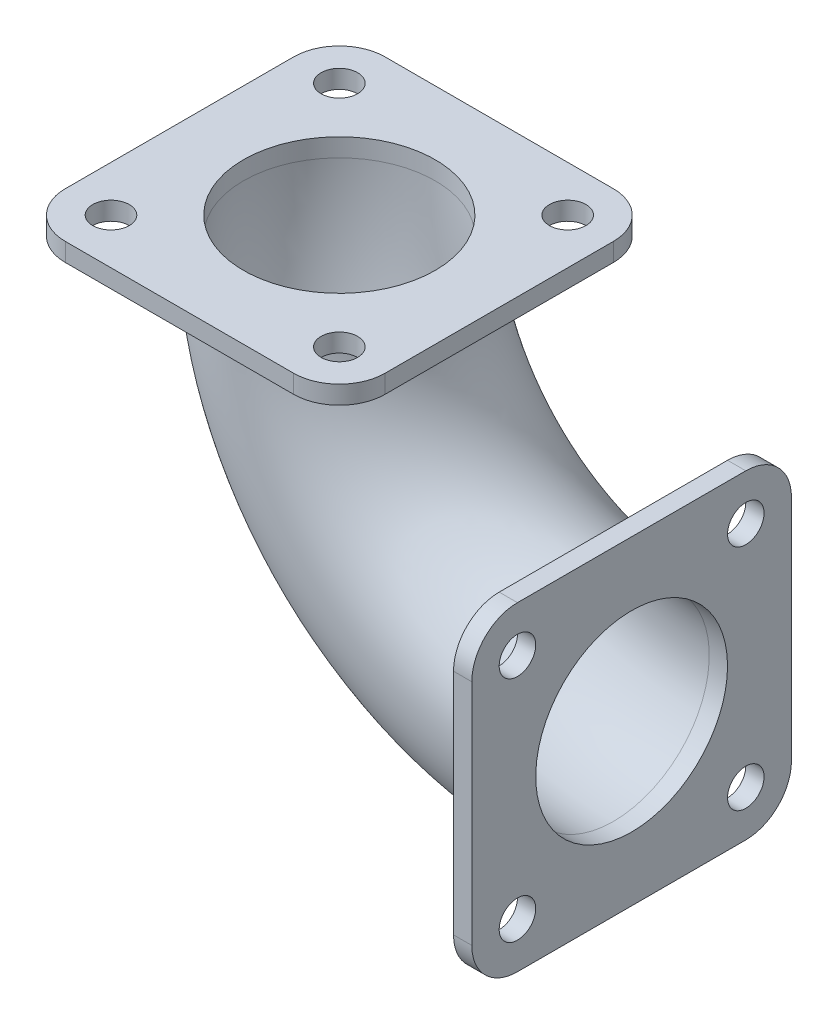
from build123d import *

# Parameters (mm, degrees)
SKETCH1_R                              = 12.5
SKETCH1_R_2                            = 10.5
REVOLVE1_ANGLE                         = 90
SKETCH2_R                              = 10.5
EXTRUDE1_DEPTH                         = 2
SKETCH4_R                              = 10.5
EXTRUDE3_DEPTH                         = 2
F_4_0_4_DIAMETER_HOLE1_D               = 4
F_4_0_4_DIAMETER_HOLE1_DEPTH           = 2
F_4_0_4_DIAMETER_HOLE1_ON_FACE_2_D     = 4
F_4_0_4_DIAMETER_HOLE1_ON_FACE_2_DEPTH = 2


with BuildPart() as part:
    # Sketch1 → Revolve1 (revolve)
    with BuildSketch(Plane(origin=(0, 0, 0), x_dir=(0, 0, -1), z_dir=(1, 0, 0))):
        Circle(SKETCH1_R)
        Circle(SKETCH1_R_2, mode=Mode.SUBTRACT)
    revolve(axis=Axis((0, 30, 23.271989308), (0, 0, -1)), revolution_arc=REVOLVE1_ANGLE)

    # Sketch2 → Extrude1 (add)
    with BuildSketch(Plane(origin=(0, 0, 0), x_dir=(0, 0, -1), z_dir=(1, 0, 0))):
        with BuildLine():
            Line((-12.5, 17.5), (12.5, 17.5))
            ThreePointArc((12.5, 17.5), (16.035533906, 16.035533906), (17.5, 12.5))
            Line((17.5, 12.5), (17.5, -12.5))
            ThreePointArc((17.5, -12.5), (16.035533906, -16.035533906), (12.5, -17.5))
            Line((12.5, -17.5), (-12.5, -17.5))
            ThreePointArc((-12.5, -17.5), (-16.035533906, -16.035533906), (-17.5, -12.5))
            Line((-17.5, -12.5), (-17.5, 12.5))
            ThreePointArc((-17.5, 12.5), (-16.035533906, 16.035533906), (-12.5, 17.5))
        make_face()
        with Locations(Location((0, 0, 0), (0, 0, 270))):
            Circle(SKETCH2_R, mode=Mode.SUBTRACT)
    extrude(amount=EXTRUDE1_DEPTH)

    # Sketch4 → Extrude3 (add)
    with BuildSketch(Plane(origin=(-35.372957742, 30, 10.282285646), x_dir=(-1, 0, 0), z_dir=(0, 1, 0))):
        with BuildLine():
            Line((-17.872957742, 7.217714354), (7.127042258, 7.217714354))
            ThreePointArc((7.127042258, 7.217714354), (10.662576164, 5.75324826), (12.127042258, 2.217714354))
            Line((12.127042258, 2.217714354), (12.127042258, -22.782285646))
            ThreePointArc((12.127042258, -22.782285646), (10.662576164, -26.317819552), (7.127042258, -27.782285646))
            Line((7.127042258, -27.782285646), (-17.872957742, -27.782285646))
            ThreePointArc((-17.872957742, -27.782285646), (-21.408491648, -26.317819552), (-22.872957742, -22.782285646))
            Line((-22.872957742, -22.782285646), (-22.872957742, 2.217714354))
            ThreePointArc((-22.872957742, 2.217714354), (-21.408491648, 5.75324826), (-17.872957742, 7.217714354))
        make_face()
        with Locations((-5.372957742, -10.282285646)):
            Circle(SKETCH4_R, mode=Mode.SUBTRACT)
    extrude(amount=EXTRUDE3_DEPTH)

    # 4.0 _4_ Diameter Hole1
    with Locations(Plane(origin=(-17.5, 32, 12.5), x_dir=(1, 0, 0), z_dir=(0, 1, 0))):
        with Locations((0, 0), (0, 25), (-25, 25), (-25, 0)):
            Hole(F_4_0_4_DIAMETER_HOLE1_D / 2, depth=F_4_0_4_DIAMETER_HOLE1_DEPTH)

    # 4.0 _4_ Diameter Hole1 on face 2
    with Locations(Plane(origin=(2, 12.5, -12.5), x_dir=(0, 0, 1), z_dir=(1, 0, 0))):
        with Locations((0, 0), (0, 25), (25, 0), (25, 25)):
            Hole(F_4_0_4_DIAMETER_HOLE1_ON_FACE_2_D / 2, depth=F_4_0_4_DIAMETER_HOLE1_ON_FACE_2_DEPTH)


solid = part.part
